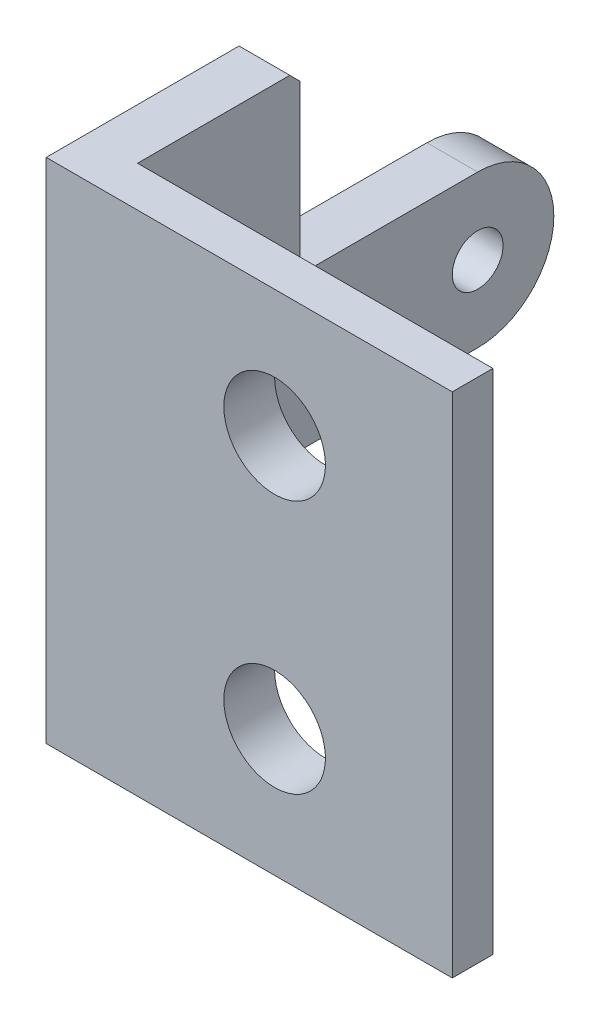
ISO-10303-21;
HEADER;
FILE_DESCRIPTION(('STEP AP214'),'2;1');
FILE_NAME('part.step','',(''),(''),'','','');
FILE_SCHEMA(('AUTOMOTIVE_DESIGN { 1 0 10303 214 1 1 1 1 }'));
ENDSEC;
DATA;
#1=APPLICATION_CONTEXT('core data for automotive mechanical design processes');
#2=APPLICATION_PROTOCOL_DEFINITION('international standard','automotive_design',2000,#1);
#3=PRODUCT_CONTEXT('',#1,'mechanical');
#4=PRODUCT('Part','Part','',(#3));
#5=PRODUCT_RELATED_PRODUCT_CATEGORY('part','',(#4));
#6=PRODUCT_DEFINITION_FORMATION('','',#4);
#7=PRODUCT_DEFINITION_CONTEXT('part definition',#1,'design');
#8=PRODUCT_DEFINITION('design','',#6,#7);
#9=PRODUCT_DEFINITION_SHAPE('','',#8);
#10=(LENGTH_UNIT() NAMED_UNIT(*) SI_UNIT(.MILLI.,.METRE.));
#11=(NAMED_UNIT(*) PLANE_ANGLE_UNIT() SI_UNIT($,.RADIAN.));
#12=(NAMED_UNIT(*) SI_UNIT($,.STERADIAN.) SOLID_ANGLE_UNIT());
#13=UNCERTAINTY_MEASURE_WITH_UNIT(LENGTH_MEASURE(1.E-05),#10,'distance_accuracy_value','');
#14=(GEOMETRIC_REPRESENTATION_CONTEXT(3) GLOBAL_UNCERTAINTY_ASSIGNED_CONTEXT((#13)) GLOBAL_UNIT_ASSIGNED_CONTEXT((#10,
#11,#12)) REPRESENTATION_CONTEXT('',''));
#15=CARTESIAN_POINT('',(0.,0.,0.));
#16=DIRECTION('',(0.,0.,1.));
#17=DIRECTION('',(1.,0.,0.));
#18=AXIS2_PLACEMENT_3D('',#15,#16,#17);
#19=CARTESIAN_POINT('',(10.,100.,-40.));
#20=DIRECTION('',(0.,0.,1.));
#21=DIRECTION('',(1.,0.,0.));
#22=AXIS2_PLACEMENT_3D('',#19,#20,#21);
#23=PLANE('',#22);
#24=DIRECTION('',(0.,-1.,0.));
#25=VECTOR('',#24,1.);
#26=CARTESIAN_POINT('',(10.,100.,-40.));
#27=LINE('',#26,#25);
#28=CARTESIAN_POINT('',(10.,35.,-40.));
#29=VERTEX_POINT('',#28);
#30=CARTESIAN_POINT('',(10.,2.00000000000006,-40.));
#31=VERTEX_POINT('',#30);
#32=EDGE_CURVE('E158',#29,#31,#27,.T.);
#33=ORIENTED_EDGE('',*,*,#32,.T.);
#34=DIRECTION('',(-1.,0.,0.));
#35=VECTOR('',#34,1.);
#36=CARTESIAN_POINT('',(10.,2.00000000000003,-40.));
#37=LINE('',#36,#35);
#38=CARTESIAN_POINT('',(0.,2.00000000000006,-40.));
#39=VERTEX_POINT('',#38);
#40=EDGE_CURVE('E213',#31,#39,#37,.T.);
#41=ORIENTED_EDGE('',*,*,#40,.T.);
#42=DIRECTION('',(0.,-1.,0.));
#43=VECTOR('',#42,1.);
#44=CARTESIAN_POINT('',(0.,100.,-40.));
#45=LINE('',#44,#43);
#46=CARTESIAN_POINT('',(0.,35.,-40.));
#47=VERTEX_POINT('',#46);
#48=EDGE_CURVE('E210',#47,#39,#45,.T.);
#49=ORIENTED_EDGE('',*,*,#48,.F.);
#50=DIRECTION('',(-1.,0.,0.));
#51=VECTOR('',#50,1.);
#52=CARTESIAN_POINT('',(10.,35.,-40.));
#53=LINE('',#52,#51);
#54=EDGE_CURVE('E145',#29,#47,#53,.T.);
#55=ORIENTED_EDGE('',*,*,#54,.F.);
#56=EDGE_LOOP('',(#33,#41,#49,#55));
#57=FACE_BOUND('',#56,.T.);
#58=ADVANCED_FACE('F33',(#57),#23,.F.);
#59=CARTESIAN_POINT('',(0.,97.9999999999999,-40.));
#60=VERTEX_POINT('',#59);
#61=CARTESIAN_POINT('',(0.,65.,-40.));
#62=VERTEX_POINT('',#61);
#63=EDGE_CURVE('E211',#60,#62,#45,.T.);
#64=ORIENTED_EDGE('',*,*,#63,.F.);
#65=DIRECTION('',(1.,0.,0.));
#66=VECTOR('',#65,1.);
#67=CARTESIAN_POINT('',(10.,97.9999999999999,-40.));
#68=LINE('',#67,#66);
#69=CARTESIAN_POINT('',(10.,97.9999999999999,-40.));
#70=VERTEX_POINT('',#69);
#71=EDGE_CURVE('E234',#60,#70,#68,.T.);
#72=ORIENTED_EDGE('',*,*,#71,.T.);
#73=CARTESIAN_POINT('',(10.,65.,-40.));
#74=VERTEX_POINT('',#73);
#75=EDGE_CURVE('E199',#70,#74,#27,.T.);
#76=ORIENTED_EDGE('',*,*,#75,.T.);
#77=DIRECTION('',(-1.,0.,0.));
#78=VECTOR('',#77,1.);
#79=CARTESIAN_POINT('',(10.,65.,-40.));
#80=LINE('',#79,#78);
#81=EDGE_CURVE('E177',#74,#62,#80,.T.);
#82=ORIENTED_EDGE('',*,*,#81,.T.);
#83=EDGE_LOOP('',(#64,#72,#76,#82));
#84=FACE_BOUND('',#83,.T.);
#85=ADVANCED_FACE('F275',(#84),#23,.F.);
#86=CARTESIAN_POINT('',(0.,100.,-40.));
#87=DIRECTION('',(1.,0.,0.));
#88=DIRECTION('',(0.,0.,-1.));
#89=AXIS2_PLACEMENT_3D('',#86,#87,#88);
#90=PLANE('',#89);
#91=ORIENTED_EDGE('',*,*,#48,.T.);
#92=DIRECTION('',(0.,0.707106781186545,-0.70710678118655));
#93=VECTOR('',#92,1.);
#94=CARTESIAN_POINT('',(0.,2.00000000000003,-40.));
#95=LINE('',#94,#93);
#96=CARTESIAN_POINT('',(0.,0.,-38.));
#97=VERTEX_POINT('',#96);
#98=EDGE_CURVE('E218',#39,#97,#95,.F.);
#99=ORIENTED_EDGE('',*,*,#98,.T.);
#100=DIRECTION('',(0.,0.,1.));
#101=VECTOR('',#100,1.);
#102=CARTESIAN_POINT('',(0.,0.,-40.));
#103=LINE('',#102,#101);
#104=CARTESIAN_POINT('',(0.,0.,0.));
#105=VERTEX_POINT('',#104);
#106=EDGE_CURVE('E176',#97,#105,#103,.T.);
#107=ORIENTED_EDGE('',*,*,#106,.T.);
#108=DIRECTION('',(0.,-1.,0.));
#109=VECTOR('',#108,1.);
#110=CARTESIAN_POINT('',(0.,100.,0.));
#111=LINE('',#110,#109);
#112=CARTESIAN_POINT('',(0.,100.,0.));
#113=VERTEX_POINT('',#112);
#114=EDGE_CURVE('E207',#113,#105,#111,.T.);
#115=ORIENTED_EDGE('',*,*,#114,.F.);
#116=DIRECTION('',(0.,0.,1.));
#117=VECTOR('',#116,1.);
#118=CARTESIAN_POINT('',(0.,100.,-40.));
#119=LINE('',#118,#117);
#120=CARTESIAN_POINT('',(0.,100.,-38.));
#121=VERTEX_POINT('',#120);
#122=EDGE_CURVE('E181',#121,#113,#119,.T.);
#123=ORIENTED_EDGE('',*,*,#122,.F.);
#124=DIRECTION('',(0.,-0.70710678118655,-0.707106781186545));
#125=VECTOR('',#124,1.);
#126=CARTESIAN_POINT('',(0.,100.,-38.));
#127=LINE('',#126,#125);
#128=EDGE_CURVE('E216',#121,#60,#127,.T.);
#129=ORIENTED_EDGE('',*,*,#128,.T.);
#130=ORIENTED_EDGE('',*,*,#63,.T.);
#131=DIRECTION('',(0.,0.,-1.));
#132=VECTOR('',#131,1.);
#133=CARTESIAN_POINT('',(0.,65.,-40.));
#134=LINE('',#133,#132);
#135=CARTESIAN_POINT('',(0.,65.,-75.));
#136=VERTEX_POINT('',#135);
#137=EDGE_CURVE('E162',#62,#136,#134,.T.);
#138=ORIENTED_EDGE('',*,*,#137,.T.);
#139=CARTESIAN_POINT('',(0.,50.,-75.));
#140=DIRECTION('',(-1.,0.,0.));
#141=DIRECTION('',(0.,0.,1.));
#142=AXIS2_PLACEMENT_3D('',#139,#140,#141);
#143=CIRCLE('',#142,15.);
#144=CARTESIAN_POINT('',(0.,35.,-75.));
#145=VERTEX_POINT('',#144);
#146=EDGE_CURVE('E171',#136,#145,#143,.T.);
#147=ORIENTED_EDGE('',*,*,#146,.T.);
#148=DIRECTION('',(0.,0.,1.));
#149=VECTOR('',#148,1.);
#150=CARTESIAN_POINT('',(0.,35.,-40.));
#151=LINE('',#150,#149);
#152=EDGE_CURVE('E140',#145,#47,#151,.T.);
#153=ORIENTED_EDGE('',*,*,#152,.T.);
#154=EDGE_LOOP('',(#91,#99,#107,#115,#123,#129,#130,#138,#147,#153));
#155=FACE_BOUND('',#154,.T.);
#156=CARTESIAN_POINT('',(0.,50.,-75.));
#157=DIRECTION('',(-1.,0.,0.));
#158=DIRECTION('',(0.,0.,1.));
#159=AXIS2_PLACEMENT_3D('',#156,#157,#158);
#160=CIRCLE('',#159,5.00000000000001);
#161=CARTESIAN_POINT('',(0.,50.,-70.));
#162=VERTEX_POINT('',#161);
#163=EDGE_CURVE('E167',#162,#162,#160,.T.);
#164=ORIENTED_EDGE('',*,*,#163,.F.);
#165=EDGE_LOOP('',(#164));
#166=FACE_BOUND('',#165,.T.);
#167=ADVANCED_FACE('F272',(#155,#166),#90,.F.);
#168=CARTESIAN_POINT('',(0.,100.,0.));
#169=DIRECTION('',(0.,0.,-1.));
#170=DIRECTION('',(-1.,0.,0.));
#171=AXIS2_PLACEMENT_3D('',#168,#169,#170);
#172=PLANE('',#171);
#173=CARTESIAN_POINT('',(45.,25.,0.));
#174=DIRECTION('',(0.,0.,-1.));
#175=DIRECTION('',(-1.,0.,0.));
#176=AXIS2_PLACEMENT_3D('',#173,#174,#175);
#177=CIRCLE('',#176,10.);
#178=CARTESIAN_POINT('',(35.,25.,0.));
#179=VERTEX_POINT('',#178);
#180=EDGE_CURVE('E253',#179,#179,#177,.T.);
#181=ORIENTED_EDGE('',*,*,#180,.T.);
#182=EDGE_LOOP('',(#181));
#183=FACE_BOUND('',#182,.T.);
#184=CARTESIAN_POINT('',(45.,75.,0.));
#185=DIRECTION('',(0.,0.,-1.));
#186=DIRECTION('',(-1.,0.,0.));
#187=AXIS2_PLACEMENT_3D('',#184,#185,#186);
#188=CIRCLE('',#187,10.);
#189=CARTESIAN_POINT('',(35.,75.,0.));
#190=VERTEX_POINT('',#189);
#191=EDGE_CURVE('E261',#190,#190,#188,.T.);
#192=ORIENTED_EDGE('',*,*,#191,.T.);
#193=EDGE_LOOP('',(#192));
#194=FACE_BOUND('',#193,.T.);
#195=DIRECTION('',(1.,0.,0.));
#196=VECTOR('',#195,1.);
#197=CARTESIAN_POINT('',(0.,0.,0.));
#198=LINE('',#197,#196);
#199=CARTESIAN_POINT('',(80.,0.,0.));
#200=VERTEX_POINT('',#199);
#201=EDGE_CURVE('E193',#105,#200,#198,.T.);
#202=ORIENTED_EDGE('',*,*,#201,.T.);
#203=DIRECTION('',(0.,-1.,0.));
#204=VECTOR('',#203,1.);
#205=CARTESIAN_POINT('',(80.,100.,0.));
#206=LINE('',#205,#204);
#207=CARTESIAN_POINT('',(80.,100.,0.));
#208=VERTEX_POINT('',#207);
#209=EDGE_CURVE('E204',#208,#200,#206,.T.);
#210=ORIENTED_EDGE('',*,*,#209,.F.);
#211=DIRECTION('',(1.,0.,0.));
#212=VECTOR('',#211,1.);
#213=CARTESIAN_POINT('',(0.,100.,0.));
#214=LINE('',#213,#212);
#215=EDGE_CURVE('E183',#113,#208,#214,.T.);
#216=ORIENTED_EDGE('',*,*,#215,.F.);
#217=ORIENTED_EDGE('',*,*,#114,.T.);
#218=EDGE_LOOP('',(#202,#210,#216,#217));
#219=FACE_BOUND('',#218,.T.);
#220=ADVANCED_FACE('F274',(#183,#194,#219),#172,.F.);
#221=CARTESIAN_POINT('',(80.,100.,0.));
#222=DIRECTION('',(-1.,0.,0.));
#223=DIRECTION('',(0.,0.,1.));
#224=AXIS2_PLACEMENT_3D('',#221,#222,#223);
#225=PLANE('',#224);
#226=DIRECTION('',(0.,0.,-1.));
#227=VECTOR('',#226,1.);
#228=CARTESIAN_POINT('',(80.,0.,0.));
#229=LINE('',#228,#227);
#230=CARTESIAN_POINT('',(80.,0.,-7.99999999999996));
#231=VERTEX_POINT('',#230);
#232=EDGE_CURVE('E195',#200,#231,#229,.T.);
#233=ORIENTED_EDGE('',*,*,#232,.T.);
#234=DIRECTION('',(0.,1.,0.));
#235=VECTOR('',#234,1.);
#236=CARTESIAN_POINT('',(80.,100.,-7.99999999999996));
#237=LINE('',#236,#235);
#238=CARTESIAN_POINT('',(80.,100.,-7.99999999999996));
#239=VERTEX_POINT('',#238);
#240=EDGE_CURVE('E240',#231,#239,#237,.T.);
#241=ORIENTED_EDGE('',*,*,#240,.T.);
#242=DIRECTION('',(0.,0.,-1.));
#243=VECTOR('',#242,1.);
#244=CARTESIAN_POINT('',(80.,100.,0.));
#245=LINE('',#244,#243);
#246=EDGE_CURVE('E186',#208,#239,#245,.T.);
#247=ORIENTED_EDGE('',*,*,#246,.F.);
#248=ORIENTED_EDGE('',*,*,#209,.T.);
#249=EDGE_LOOP('',(#233,#241,#247,#248));
#250=FACE_BOUND('',#249,.T.);
#251=ADVANCED_FACE('F283',(#250),#225,.F.);
#252=CARTESIAN_POINT('',(80.,100.,-10.));
#253=DIRECTION('',(0.,0.,1.));
#254=DIRECTION('',(1.,0.,0.));
#255=AXIS2_PLACEMENT_3D('',#252,#253,#254);
#256=PLANE('',#255);
#257=CARTESIAN_POINT('',(45.,25.,-9.99999999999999));
#258=DIRECTION('',(0.,0.,-1.));
#259=DIRECTION('',(-1.,0.,0.));
#260=AXIS2_PLACEMENT_3D('',#257,#258,#259);
#261=CIRCLE('',#260,10.);
#262=CARTESIAN_POINT('',(35.,25.,-9.99999999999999));
#263=VERTEX_POINT('',#262);
#264=EDGE_CURVE('E248',#263,#263,#261,.T.);
#265=ORIENTED_EDGE('',*,*,#264,.F.);
#266=EDGE_LOOP('',(#265));
#267=FACE_BOUND('',#266,.T.);
#268=CARTESIAN_POINT('',(45.,75.,-9.99999999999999));
#269=DIRECTION('',(0.,0.,-1.));
#270=DIRECTION('',(-1.,0.,0.));
#271=AXIS2_PLACEMENT_3D('',#268,#269,#270);
#272=CIRCLE('',#271,10.);
#273=CARTESIAN_POINT('',(35.,75.,-9.99999999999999));
#274=VERTEX_POINT('',#273);
#275=EDGE_CURVE('E258',#274,#274,#272,.T.);
#276=ORIENTED_EDGE('',*,*,#275,.F.);
#277=EDGE_LOOP('',(#276));
#278=FACE_BOUND('',#277,.T.);
#279=DIRECTION('',(0.,-1.,0.));
#280=VECTOR('',#279,1.);
#281=CARTESIAN_POINT('',(9.99999999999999,100.,-9.99999999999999));
#282=LINE('',#281,#280);
#283=CARTESIAN_POINT('',(9.99999999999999,98.,-9.99999999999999));
#284=VERTEX_POINT('',#283);
#285=CARTESIAN_POINT('',(9.99999999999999,2.00000000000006,-9.99999999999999));
#286=VERTEX_POINT('',#285);
#287=EDGE_CURVE('E201',#284,#286,#282,.T.);
#288=ORIENTED_EDGE('',*,*,#287,.F.);
#289=DIRECTION('',(1.,0.,0.));
#290=VECTOR('',#289,1.);
#291=CARTESIAN_POINT('',(80.,98.,-10.));
#292=LINE('',#291,#290);
#293=CARTESIAN_POINT('',(78.,98.,-10.));
#294=VERTEX_POINT('',#293);
#295=EDGE_CURVE('E50',#284,#294,#292,.T.);
#296=ORIENTED_EDGE('',*,*,#295,.T.);
#297=DIRECTION('',(0.,-1.,0.));
#298=VECTOR('',#297,1.);
#299=CARTESIAN_POINT('',(78.,100.,-10.));
#300=LINE('',#299,#298);
#301=CARTESIAN_POINT('',(78.,2.00000000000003,-10.));
#302=VERTEX_POINT('',#301);
#303=EDGE_CURVE('E54',#294,#302,#300,.T.);
#304=ORIENTED_EDGE('',*,*,#303,.T.);
#305=DIRECTION('',(-1.,0.,0.));
#306=VECTOR('',#305,1.);
#307=CARTESIAN_POINT('',(80.,2.00000000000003,-10.));
#308=LINE('',#307,#306);
#309=EDGE_CURVE('E236',#302,#286,#308,.T.);
#310=ORIENTED_EDGE('',*,*,#309,.T.);
#311=EDGE_LOOP('',(#288,#296,#304,#310));
#312=FACE_BOUND('',#311,.T.);
#313=ADVANCED_FACE('F318',(#267,#278,#312),#256,.F.);
#314=CARTESIAN_POINT('',(9.99999999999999,100.,-9.99999999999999));
#315=DIRECTION('',(-1.,0.,0.));
#316=DIRECTION('',(0.,0.,1.));
#317=AXIS2_PLACEMENT_3D('',#314,#315,#316);
#318=PLANE('',#317);
#319=DIRECTION('',(0.,0.,-1.));
#320=VECTOR('',#319,1.);
#321=CARTESIAN_POINT('',(9.99999999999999,0.,-9.99999999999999));
#322=LINE('',#321,#320);
#323=CARTESIAN_POINT('',(9.99999999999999,0.,-7.99999999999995));
#324=VERTEX_POINT('',#323);
#325=CARTESIAN_POINT('',(10.,0.,-38.));
#326=VERTEX_POINT('',#325);
#327=EDGE_CURVE('E184',#324,#326,#322,.T.);
#328=ORIENTED_EDGE('',*,*,#327,.T.);
#329=DIRECTION('',(0.,-0.707106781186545,0.70710678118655));
#330=VECTOR('',#329,1.);
#331=CARTESIAN_POINT('',(10.,2.00000000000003,-40.));
#332=LINE('',#331,#330);
#333=EDGE_CURVE('E226',#326,#31,#332,.F.);
#334=ORIENTED_EDGE('',*,*,#333,.T.);
#335=ORIENTED_EDGE('',*,*,#32,.F.);
#336=DIRECTION('',(0.,0.,1.));
#337=VECTOR('',#336,1.);
#338=CARTESIAN_POINT('',(10.,35.,-40.));
#339=LINE('',#338,#337);
#340=CARTESIAN_POINT('',(10.,35.,-75.));
#341=VERTEX_POINT('',#340);
#342=EDGE_CURVE('E137',#341,#29,#339,.T.);
#343=ORIENTED_EDGE('',*,*,#342,.F.);
#344=CARTESIAN_POINT('',(10.,50.,-75.));
#345=DIRECTION('',(-1.,0.,0.));
#346=DIRECTION('',(0.,0.,1.));
#347=AXIS2_PLACEMENT_3D('',#344,#345,#346);
#348=CIRCLE('',#347,15.);
#349=CARTESIAN_POINT('',(10.,65.,-75.));
#350=VERTEX_POINT('',#349);
#351=EDGE_CURVE('E155',#350,#341,#348,.T.);
#352=ORIENTED_EDGE('',*,*,#351,.F.);
#353=DIRECTION('',(0.,0.,-1.));
#354=VECTOR('',#353,1.);
#355=CARTESIAN_POINT('',(10.,65.,-40.));
#356=LINE('',#355,#354);
#357=EDGE_CURVE('E146',#74,#350,#356,.T.);
#358=ORIENTED_EDGE('',*,*,#357,.F.);
#359=ORIENTED_EDGE('',*,*,#75,.F.);
#360=DIRECTION('',(0.,0.70710678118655,0.707106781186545));
#361=VECTOR('',#360,1.);
#362=CARTESIAN_POINT('',(10.,100.,-38.));
#363=LINE('',#362,#361);
#364=CARTESIAN_POINT('',(10.,100.,-38.));
#365=VERTEX_POINT('',#364);
#366=EDGE_CURVE('E224',#70,#365,#363,.T.);
#367=ORIENTED_EDGE('',*,*,#366,.T.);
#368=DIRECTION('',(0.,0.,-1.));
#369=VECTOR('',#368,1.);
#370=CARTESIAN_POINT('',(9.99999999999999,100.,-9.99999999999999));
#371=LINE('',#370,#369);
#372=CARTESIAN_POINT('',(9.99999999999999,100.,-7.99999999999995));
#373=VERTEX_POINT('',#372);
#374=EDGE_CURVE('E189',#373,#365,#371,.T.);
#375=ORIENTED_EDGE('',*,*,#374,.F.);
#376=DIRECTION('',(0.,-0.707106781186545,-0.70710678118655));
#377=VECTOR('',#376,1.);
#378=CARTESIAN_POINT('',(9.99999999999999,99.,-8.99999999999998));
#379=LINE('',#378,#377);
#380=EDGE_CURVE('E42',#373,#284,#379,.T.);
#381=ORIENTED_EDGE('',*,*,#380,.T.);
#382=ORIENTED_EDGE('',*,*,#287,.T.);
#383=DIRECTION('',(0.,0.707106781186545,-0.70710678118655));
#384=VECTOR('',#383,1.);
#385=CARTESIAN_POINT('',(10.,50.9999999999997,-59.));
#386=LINE('',#385,#384);
#387=EDGE_CURVE('E11',#286,#324,#386,.F.);
#388=ORIENTED_EDGE('',*,*,#387,.T.);
#389=EDGE_LOOP('',(#328,#334,#335,#343,#352,#358,#359,#367,#375,#381,#382,#388));
#390=FACE_BOUND('',#389,.T.);
#391=CARTESIAN_POINT('',(10.,50.,-75.));
#392=DIRECTION('',(-1.,0.,0.));
#393=DIRECTION('',(0.,0.,1.));
#394=AXIS2_PLACEMENT_3D('',#391,#392,#393);
#395=CIRCLE('',#394,5.00000000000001);
#396=CARTESIAN_POINT('',(10.,50.,-70.));
#397=VERTEX_POINT('',#396);
#398=EDGE_CURVE('E173',#397,#397,#395,.T.);
#399=ORIENTED_EDGE('',*,*,#398,.T.);
#400=EDGE_LOOP('',(#399));
#401=FACE_BOUND('',#400,.T.);
#402=ADVANCED_FACE('F152',(#390,#401),#318,.F.);
#403=CARTESIAN_POINT('',(0.,100.,0.));
#404=DIRECTION('',(0.,1.,0.));
#405=DIRECTION('',(0.,0.,1.));
#406=AXIS2_PLACEMENT_3D('',#403,#404,#405);
#407=PLANE('',#406);
#408=ORIENTED_EDGE('',*,*,#374,.T.);
#409=DIRECTION('',(-1.,0.,0.));
#410=VECTOR('',#409,1.);
#411=CARTESIAN_POINT('',(0.,100.,-38.));
#412=LINE('',#411,#410);
#413=EDGE_CURVE('E231',#365,#121,#412,.T.);
#414=ORIENTED_EDGE('',*,*,#413,.T.);
#415=ORIENTED_EDGE('',*,*,#122,.T.);
#416=ORIENTED_EDGE('',*,*,#215,.T.);
#417=ORIENTED_EDGE('',*,*,#246,.T.);
#418=DIRECTION('',(-1.,0.,0.));
#419=VECTOR('',#418,1.);
#420=CARTESIAN_POINT('',(9.99999999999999,100.,-7.99999999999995));
#421=LINE('',#420,#419);
#422=EDGE_CURVE('E228',#239,#373,#421,.T.);
#423=ORIENTED_EDGE('',*,*,#422,.T.);
#424=EDGE_LOOP('',(#408,#414,#415,#416,#417,#423));
#425=FACE_BOUND('',#424,.T.);
#426=ADVANCED_FACE('F320',(#425),#407,.T.);
#427=CARTESIAN_POINT('',(0.,0.,0.));
#428=DIRECTION('',(0.,1.,0.));
#429=DIRECTION('',(0.,0.,1.));
#430=AXIS2_PLACEMENT_3D('',#427,#428,#429);
#431=PLANE('',#430);
#432=ORIENTED_EDGE('',*,*,#106,.F.);
#433=DIRECTION('',(1.,0.,0.));
#434=VECTOR('',#433,1.);
#435=CARTESIAN_POINT('',(0.,0.,-38.));
#436=LINE('',#435,#434);
#437=EDGE_CURVE('E222',#97,#326,#436,.T.);
#438=ORIENTED_EDGE('',*,*,#437,.T.);
#439=ORIENTED_EDGE('',*,*,#327,.F.);
#440=DIRECTION('',(1.,0.,0.));
#441=VECTOR('',#440,1.);
#442=CARTESIAN_POINT('',(0.,0.,-7.99999999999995));
#443=LINE('',#442,#441);
#444=EDGE_CURVE('E220',#324,#231,#443,.T.);
#445=ORIENTED_EDGE('',*,*,#444,.T.);
#446=ORIENTED_EDGE('',*,*,#232,.F.);
#447=ORIENTED_EDGE('',*,*,#201,.F.);
#448=EDGE_LOOP('',(#432,#438,#439,#445,#446,#447));
#449=FACE_BOUND('',#448,.T.);
#450=ADVANCED_FACE('F330',(#449),#431,.F.);
#451=CARTESIAN_POINT('',(10.,50.,-75.));
#452=DIRECTION('',(-1.,0.,0.));
#453=DIRECTION('',(0.,0.,1.));
#454=AXIS2_PLACEMENT_3D('',#451,#452,#453);
#455=CYLINDRICAL_SURFACE('',#454,15.);
#456=ORIENTED_EDGE('',*,*,#146,.F.);
#457=DIRECTION('',(-1.,0.,0.));
#458=VECTOR('',#457,1.);
#459=CARTESIAN_POINT('',(10.,65.,-75.));
#460=LINE('',#459,#458);
#461=EDGE_CURVE('E161',#350,#136,#460,.T.);
#462=ORIENTED_EDGE('',*,*,#461,.F.);
#463=ORIENTED_EDGE('',*,*,#351,.T.);
#464=DIRECTION('',(-1.,0.,0.));
#465=VECTOR('',#464,1.);
#466=CARTESIAN_POINT('',(10.,35.,-75.));
#467=LINE('',#466,#465);
#468=EDGE_CURVE('E134',#341,#145,#467,.T.);
#469=ORIENTED_EDGE('',*,*,#468,.T.);
#470=EDGE_LOOP('',(#456,#462,#463,#469));
#471=FACE_BOUND('',#470,.T.);
#472=ADVANCED_FACE('F160',(#471),#455,.T.);
#473=CARTESIAN_POINT('',(10.,65.,-40.));
#474=DIRECTION('',(0.,1.,0.));
#475=DIRECTION('',(0.,0.,1.));
#476=AXIS2_PLACEMENT_3D('',#473,#474,#475);
#477=PLANE('',#476);
#478=ORIENTED_EDGE('',*,*,#137,.F.);
#479=ORIENTED_EDGE('',*,*,#81,.F.);
#480=ORIENTED_EDGE('',*,*,#357,.T.);
#481=ORIENTED_EDGE('',*,*,#461,.T.);
#482=EDGE_LOOP('',(#478,#479,#480,#481));
#483=FACE_BOUND('',#482,.T.);
#484=ADVANCED_FACE('F338',(#483),#477,.T.);
#485=CARTESIAN_POINT('',(10.,35.,-40.));
#486=DIRECTION('',(0.,-1.,0.));
#487=DIRECTION('',(0.,0.,-1.));
#488=AXIS2_PLACEMENT_3D('',#485,#486,#487);
#489=PLANE('',#488);
#490=ORIENTED_EDGE('',*,*,#152,.F.);
#491=ORIENTED_EDGE('',*,*,#468,.F.);
#492=ORIENTED_EDGE('',*,*,#342,.T.);
#493=ORIENTED_EDGE('',*,*,#54,.T.);
#494=EDGE_LOOP('',(#490,#491,#492,#493));
#495=FACE_BOUND('',#494,.T.);
#496=ADVANCED_FACE('F136',(#495),#489,.T.);
#497=CARTESIAN_POINT('',(10.,50.,-75.));
#498=DIRECTION('',(-1.,0.,0.));
#499=DIRECTION('',(0.,0.,1.));
#500=AXIS2_PLACEMENT_3D('',#497,#498,#499);
#501=CYLINDRICAL_SURFACE('',#500,5.00000000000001);
#502=ORIENTED_EDGE('',*,*,#398,.F.);
#503=EDGE_LOOP('',(#502));
#504=FACE_BOUND('',#503,.T.);
#505=ORIENTED_EDGE('',*,*,#163,.T.);
#506=EDGE_LOOP('',(#505));
#507=FACE_BOUND('',#506,.T.);
#508=ADVANCED_FACE('F270',(#504,#507),#501,.F.);
#509=CARTESIAN_POINT('',(45.,75.,0.));
#510=DIRECTION('',(0.,0.,-1.));
#511=DIRECTION('',(-1.,0.,0.));
#512=AXIS2_PLACEMENT_3D('',#509,#510,#511);
#513=CYLINDRICAL_SURFACE('',#512,10.);
#514=ORIENTED_EDGE('',*,*,#191,.F.);
#515=EDGE_LOOP('',(#514));
#516=FACE_BOUND('',#515,.T.);
#517=ORIENTED_EDGE('',*,*,#275,.T.);
#518=EDGE_LOOP('',(#517));
#519=FACE_BOUND('',#518,.T.);
#520=ADVANCED_FACE('F415',(#516,#519),#513,.F.);
#521=CARTESIAN_POINT('',(45.,25.,0.));
#522=DIRECTION('',(0.,0.,-1.));
#523=DIRECTION('',(-1.,0.,0.));
#524=AXIS2_PLACEMENT_3D('',#521,#522,#523);
#525=CYLINDRICAL_SURFACE('',#524,10.);
#526=ORIENTED_EDGE('',*,*,#180,.F.);
#527=EDGE_LOOP('',(#526));
#528=FACE_BOUND('',#527,.T.);
#529=ORIENTED_EDGE('',*,*,#264,.T.);
#530=EDGE_LOOP('',(#529));
#531=FACE_BOUND('',#530,.T.);
#532=ADVANCED_FACE('F299',(#528,#531),#525,.F.);
#533=CARTESIAN_POINT('',(10.,2.00000000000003,-40.));
#534=DIRECTION('',(0.,0.70710678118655,0.707106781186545));
#535=DIRECTION('',(-1.,0.,0.));
#536=AXIS2_PLACEMENT_3D('',#533,#534,#535);
#537=PLANE('',#536);
#538=ORIENTED_EDGE('',*,*,#333,.F.);
#539=ORIENTED_EDGE('',*,*,#437,.F.);
#540=ORIENTED_EDGE('',*,*,#98,.F.);
#541=ORIENTED_EDGE('',*,*,#40,.F.);
#542=EDGE_LOOP('',(#538,#539,#540,#541));
#543=FACE_BOUND('',#542,.T.);
#544=ADVANCED_FACE('F295',(#543),#537,.F.);
#545=CARTESIAN_POINT('',(0.,100.,-38.));
#546=DIRECTION('',(0.,0.707106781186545,-0.70710678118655));
#547=DIRECTION('',(1.,0.,0.));
#548=AXIS2_PLACEMENT_3D('',#545,#546,#547);
#549=PLANE('',#548);
#550=ORIENTED_EDGE('',*,*,#366,.F.);
#551=ORIENTED_EDGE('',*,*,#71,.F.);
#552=ORIENTED_EDGE('',*,*,#128,.F.);
#553=ORIENTED_EDGE('',*,*,#413,.F.);
#554=EDGE_LOOP('',(#550,#551,#552,#553));
#555=FACE_BOUND('',#554,.T.);
#556=ADVANCED_FACE('F298',(#555),#549,.T.);
#557=CARTESIAN_POINT('',(80.,2.00000000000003,-10.));
#558=DIRECTION('',(0.,0.70710678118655,0.707106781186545));
#559=DIRECTION('',(-1.,0.,0.));
#560=AXIS2_PLACEMENT_3D('',#557,#558,#559);
#561=PLANE('',#560);
#562=ORIENTED_EDGE('',*,*,#387,.F.);
#563=ORIENTED_EDGE('',*,*,#309,.F.);
#564=DIRECTION('',(0.577350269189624,-0.577350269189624,0.577350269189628));
#565=VECTOR('',#564,1.);
#566=CARTESIAN_POINT('',(78.6666666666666,1.33333333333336,-9.33333333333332));
#567=LINE('',#566,#565);
#568=EDGE_CURVE('E37',#231,#302,#567,.F.);
#569=ORIENTED_EDGE('',*,*,#568,.F.);
#570=ORIENTED_EDGE('',*,*,#444,.F.);
#571=EDGE_LOOP('',(#562,#563,#569,#570));
#572=FACE_BOUND('',#571,.T.);
#573=ADVANCED_FACE('F35',(#572),#561,.F.);
#574=CARTESIAN_POINT('',(78.,100.,-10.));
#575=DIRECTION('',(-0.70710678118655,0.,0.707106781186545));
#576=DIRECTION('',(0.,-1.,0.));
#577=AXIS2_PLACEMENT_3D('',#574,#575,#576);
#578=PLANE('',#577);
#579=ORIENTED_EDGE('',*,*,#568,.T.);
#580=ORIENTED_EDGE('',*,*,#303,.F.);
#581=DIRECTION('',(-0.577350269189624,-0.577350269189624,-0.577350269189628));
#582=VECTOR('',#581,1.);
#583=CARTESIAN_POINT('',(78.6666666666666,98.6666666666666,-9.33333333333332));
#584=LINE('',#583,#582);
#585=EDGE_CURVE('E242',#239,#294,#584,.T.);
#586=ORIENTED_EDGE('',*,*,#585,.F.);
#587=ORIENTED_EDGE('',*,*,#240,.F.);
#588=EDGE_LOOP('',(#579,#580,#586,#587));
#589=FACE_BOUND('',#588,.T.);
#590=ADVANCED_FACE('F306',(#589),#578,.F.);
#591=CARTESIAN_POINT('',(0.,100.,-7.99999999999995));
#592=DIRECTION('',(0.,0.70710678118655,-0.707106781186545));
#593=DIRECTION('',(1.,0.,0.));
#594=AXIS2_PLACEMENT_3D('',#591,#592,#593);
#595=PLANE('',#594);
#596=ORIENTED_EDGE('',*,*,#585,.T.);
#597=ORIENTED_EDGE('',*,*,#295,.F.);
#598=ORIENTED_EDGE('',*,*,#380,.F.);
#599=ORIENTED_EDGE('',*,*,#422,.F.);
#600=EDGE_LOOP('',(#596,#597,#598,#599));
#601=FACE_BOUND('',#600,.T.);
#602=ADVANCED_FACE('F304',(#601),#595,.T.);
#603=CLOSED_SHELL('',(#58,#85,#167,#220,#251,#313,#402,#426,#450,#472,#484,#496,#508,#520,#532,
#544,#556,#573,#590,#602));
#604=MANIFOLD_SOLID_BREP('B2',#603);
#605=ADVANCED_BREP_SHAPE_REPRESENTATION('',(#18,#604),#14);
#606=SHAPE_DEFINITION_REPRESENTATION(#9,#605);
ENDSEC;
END-ISO-10303-21;
